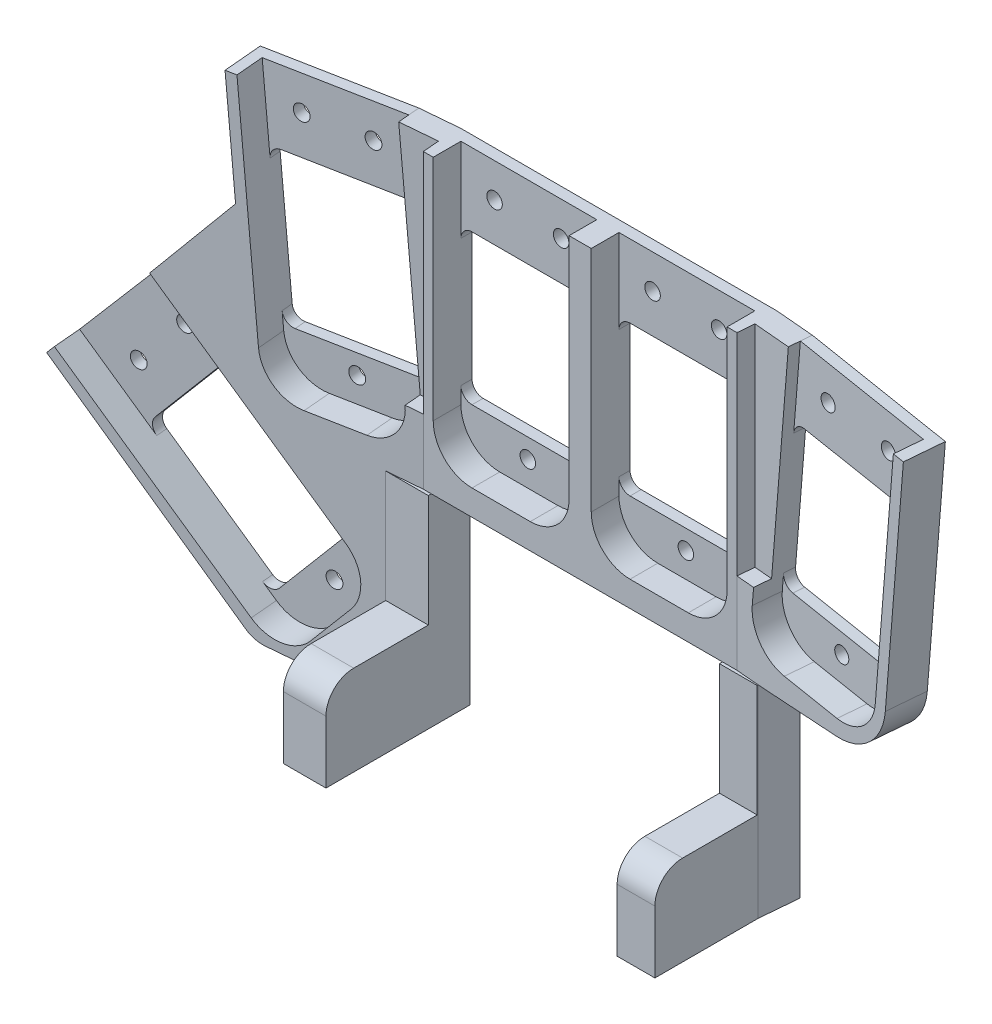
from build123d import *

# Parameters (mm, degrees)
EXTRUDE_3_DEPTH           = 2
EXTRUDE_4_DEPTH           = 5
SKETCH_5_R                = 1.4
CUT_EXTRUDE_1_DEPTH       = 5
EXTRUDE_5_DEPTH           = 52.129230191
SKETCH_8_R                = 1.4
CUT_EXTRUDE_2_DEPTH       = 54
EXTRUDE_6_DEPTH           = 5
EXTRUDE_7_DEPTH           = 52.129230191
EXTRUDE_8_DEPTH           = 5
SKETCH_12_R               = 1.4
CUT_EXTRUDE_3_DEPTH       = 5
EXTRUDE_9_DEPTH           = 48
SKETCH_16_W               = 1.992389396
SKETCH_16_H               = 100.129230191
EXTRUDE_10_DEPTH          = 31
EXTRUDE_12_DEPTH          = 5
SKETCH_20_R               = 1.4
CUT_EXTRUDE_4_DEPTH       = 5
SKETCH_22_R               = 1.4
CUT_EXTRUDE_5_DEPTH       = 126.647084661
CUT_EXTRUDE_6_DEPTH       = 126.647084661
CUT_EXTRUDE_7_DEPTH       = 126.549675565
SKETCH_25_W               = 6.808711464
SKETCH_25_H               = 36.46101183
SKETCH_25_W_2             = 7.679638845
EXTRUDE_14_DEPTH          = 19
CUT_EXTRUDE_8_DEPTH       = 123.081566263
CUT_EXTRUDE_8_DEPTH_BACK  = 123.081566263
SKETCH_26_W               = 24.786483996
SKETCH_26_H               = 10.930361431
SKETCH_26_W_2             = 52.20763572
SKETCH_26_W_3             = 6.238333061
CUT_EXTRUDE_9_DEPTH       = 116.857490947
CUT_EXTRUDE_10_DEPTH      = 118.224183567
CUT_EXTRUDE_11_DEPTH      = 118.323637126
CUT_EXTRUDE_11_DEPTH_BACK = 118.323637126
CUT_EXTRUDE_13_DEPTH      = 118.224183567
CUT_EXTRUDE_13_DEPTH_BACK = 118.224183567
CUT_EXTRUDE_15_DEPTH      = 3
CUT_EXTRUDE_16_DEPTH      = 3
SKETCH_35_W               = 52.511649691
SKETCH_35_H               = 36.46101183
CUT_EXTRUDE_18_DEPTH      = 11
SKETCH_36_R               = 1.4
CUT_EXTRUDE_19_DEPTH      = 5
FILLET_1_R                = 10
SKETCH_37_W               = 18.454216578
SKETCH_37_H               = 20.228048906
CUT_EXTRUDE_20_DEPTH      = 67
FILLET_2_R                = 5


with BuildPart() as part:
    # Sketch 1 → Extrude 3 (new body)
    with BuildSketch(Plane.XY):
        with BuildLine():
            ThreePointArc((-6.317132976, 11.564038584), (-6.902919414, 12.978252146), (-8.317132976, 13.564038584))
            Line((-8.317132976, 13.564038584), (-28.817132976, 13.564038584))
            ThreePointArc((-28.817132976, 13.564038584), (-30.231346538, 12.978252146), (-30.817132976, 11.564038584))
            Line((-30.817132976, 11.564038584), (-30.817132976, 26.719925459))
            Line((-30.817132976, 26.719925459), (-6.317132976, 26.719925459))
            Line((-6.317132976, 26.719925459), (-6.317132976, 11.564038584))
        make_face()
        with BuildLine():
            ThreePointArc((22.182867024, 11.564038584), (21.597080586, 12.978252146), (20.182867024, 13.564038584))
            Line((20.182867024, 13.564038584), (-0.317132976, 13.564038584))
            ThreePointArc((-0.317132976, 13.564038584), (-1.731346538, 12.978252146), (-2.317132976, 11.564038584))
            Line((-2.317132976, 11.564038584), (-2.317132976, 26.719925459))
            Line((-2.317132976, 26.719925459), (22.182867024, 26.719925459))
            Line((22.182867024, 26.719925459), (22.182867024, 11.564038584))
        make_face()
        with BuildLine():
            Line((-2.317132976, -11.435961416), (-2.317132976, -14.435961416))
            ThreePointArc((-2.317132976, -14.435961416), (-0.266880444, -19.385708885), (4.682867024, -21.435961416))
            Line((4.682867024, -21.435961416), (15.182867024, -21.435961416))
            ThreePointArc((15.182867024, -21.435961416), (20.132614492, -19.385708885), (22.182867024, -14.435961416))
            Line((22.182867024, -14.435961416), (22.182867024, -11.435961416))
            ThreePointArc((22.182867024, -11.435961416), (21.597080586, -12.850174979), (20.182867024, -13.435961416))
            Line((20.182867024, -13.435961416), (-0.317132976, -13.435961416))
            ThreePointArc((-0.317132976, -13.435961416), (-1.731346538, -12.850174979), (-2.317132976, -11.435961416))
        make_face()
        with BuildLine():
            Line((-30.817132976, -11.435961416), (-30.817132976, -14.435961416))
            ThreePointArc((-30.817132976, -14.435961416), (-28.766880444, -19.385708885), (-23.817132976, -21.435961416))
            Line((-23.817132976, -21.435961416), (-13.317132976, -21.435961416))
            ThreePointArc((-13.317132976, -21.435961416), (-8.367385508, -19.385708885), (-6.317132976, -14.435961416))
            Line((-6.317132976, -14.435961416), (-6.317132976, -11.435961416))
            ThreePointArc((-6.317132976, -11.435961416), (-6.902919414, -12.850174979), (-8.317132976, -13.435961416))
            Line((-8.317132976, -13.435961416), (-28.817132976, -13.435961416))
            ThreePointArc((-28.817132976, -13.435961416), (-30.231346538, -12.850174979), (-30.817132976, -11.435961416))
        make_face()
        with BuildLine():
            ThreePointArc((-2.317132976, -14.435961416), (-0.266880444, -19.385708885), (4.682867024, -21.435961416))
            Line((4.682867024, -21.435961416), (15.182867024, -21.435961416))
            ThreePointArc((15.182867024, -21.435961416), (20.132614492, -19.385708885), (22.182867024, -14.435961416))
            Line((22.182867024, -14.435961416), (22.182867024, -11.435961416))
            Line((22.182867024, -11.435961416), (22.182867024, 11.564038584))
            Line((22.182867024, 11.564038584), (22.182867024, 26.719925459))
            Line((22.182867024, 26.719925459), (24.182867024, 26.719925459))
            Line((24.182867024, 26.719925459), (24.182867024, -25.409304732))
            Line((24.182867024, -25.409304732), (-32.817132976, -25.409304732))
            Line((-32.817132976, -25.409304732), (-32.817132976, 26.719925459))
            Line((-32.817132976, 26.719925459), (-30.817132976, 26.719925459))
            Line((-30.817132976, 26.719925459), (-30.817132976, 11.564038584))
            Line((-30.817132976, 11.564038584), (-30.817132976, -11.435961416))
            Line((-30.817132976, -11.435961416), (-30.817132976, -14.435961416))
            ThreePointArc((-30.817132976, -14.435961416), (-28.766880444, -19.385708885), (-23.817132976, -21.435961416))
            Line((-23.817132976, -21.435961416), (-13.317132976, -21.435961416))
            ThreePointArc((-13.317132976, -21.435961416), (-8.367385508, -19.385708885), (-6.317132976, -14.435961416))
            Line((-6.317132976, -14.435961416), (-6.317132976, -11.435961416))
            Line((-6.317132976, -11.435961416), (-6.317132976, 11.564038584))
            Line((-6.317132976, 11.564038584), (-6.317132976, 26.719925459))
            Line((-6.317132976, 26.719925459), (-2.317132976, 26.719925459))
            Line((-2.317132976, 26.719925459), (-2.317132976, 11.564038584))
            Line((-2.317132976, 11.564038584), (-2.317132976, -11.435961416))
            Line((-2.317132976, -11.435961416), (-2.317132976, -14.435961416))
        make_face()
    extrude(amount=EXTRUDE_3_DEPTH)

    # Sketch 4 → Extrude 4 (add)
    with BuildSketch(Plane.XY.offset(2)):
        with BuildLine():
            Line((4.682867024, -21.435961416), (15.182867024, -21.435961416))
            ThreePointArc((15.182867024, -21.435961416), (20.132614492, -19.385708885), (22.182867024, -14.435961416))
            Line((22.182867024, -14.435961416), (22.182867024, -11.435961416))
            Line((22.182867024, -11.435961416), (22.182867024, 11.564038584))
            Line((22.182867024, 11.564038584), (22.182867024, 26.719925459))
            Line((22.182867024, 26.719925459), (24.182867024, 26.719925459))
            Line((24.182867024, 26.719925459), (24.182867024, -25.409304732))
            Line((24.182867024, -25.409304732), (-32.817132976, -25.409304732))
            Line((-32.817132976, -25.409304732), (-32.817132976, 26.719925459))
            Line((-32.817132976, 26.719925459), (-30.817132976, 26.719925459))
            Line((-30.817132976, 26.719925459), (-30.817132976, 11.564038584))
            Line((-30.817132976, 11.564038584), (-30.817132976, -11.435961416))
            Line((-30.817132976, -11.435961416), (-30.817132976, -14.435961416))
            ThreePointArc((-30.817132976, -14.435961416), (-28.766880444, -19.385708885), (-23.817132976, -21.435961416))
            Line((-23.817132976, -21.435961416), (-13.317132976, -21.435961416))
            ThreePointArc((-13.317132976, -21.435961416), (-8.367385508, -19.385708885), (-6.317132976, -14.435961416))
            Line((-6.317132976, -14.435961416), (-6.317132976, -11.435961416))
            Line((-6.317132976, -11.435961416), (-6.317132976, 11.564038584))
            Line((-6.317132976, 11.564038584), (-6.317132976, 26.719925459))
            Line((-6.317132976, 26.719925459), (-2.317132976, 26.719925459))
            Line((-2.317132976, 26.719925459), (-2.317132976, 11.564038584))
            Line((-2.317132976, 11.564038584), (-2.317132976, -11.435961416))
            Line((-2.317132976, -11.435961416), (-2.317132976, -14.435961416))
            ThreePointArc((-2.317132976, -14.435961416), (-0.266880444, -19.385708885), (4.682867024, -21.435961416))
        make_face()
    extrude(amount=EXTRUDE_4_DEPTH)

    # Sketch 5 → Cut-Extrude 1 (cut)
    with BuildSketch(Plane.XY.offset(2)):
        with Locations((9.746956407, -16.935961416)):
            Circle(SKETCH_5_R)
        with Locations((-18.753043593, -16.935961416)):
            Circle(SKETCH_5_R)
        with Locations((-24.753043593, 20.564038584)):
            Circle(SKETCH_5_R)
        with Locations((-12.753043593, 20.564038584)):
            Circle(SKETCH_5_R)
        with Locations((3.746956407, 20.564038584)):
            Circle(SKETCH_5_R)
        with Locations((15.746956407, 20.564038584)):
            Circle(SKETCH_5_R)
    extrude(amount=-CUT_EXTRUDE_1_DEPTH, mode=Mode.SUBTRACT)

    # Sketch 7 → Extrude 5 (add)
    with BuildSketch(Plane(origin=(0, 26.719925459, 0), x_dir=(1, 0, 0), z_dir=(0, 1, 0))):
        Polygon((-32.817132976, 0), (-70.226687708, -3.272911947), (-70.05303953, -5.2577197), (-32.817132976, -2), align=None)
    extrude(amount=-EXTRUDE_5_DEPTH)

    # Sketch 8 → Cut-Extrude 2 (cut)
    with BuildSketch(Plane(origin=(-0.075634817, 0, -0.864509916), x_dir=(0.9961946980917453, 0, -0.08715574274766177), z_dir=(0.08715574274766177, 0, 0.9961946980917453))):
        with Locations((-57.531809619, 18.980668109)):
            Circle(SKETCH_8_R)
        with Locations((-45.577473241, 20.026537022)):
            Circle(SKETCH_8_R)
        with Locations((-48.286301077, -17.853698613)):
            Circle(SKETCH_8_R)
        with BuildLine():
            Line((-38.381651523, 11.621711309), (-36.377069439, -11.290766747))
            ThreePointArc((-36.377069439, -11.290766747), (-36.837369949, -12.750653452), (-38.19514735, -13.457467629))
            Line((-38.19514735, -13.457467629), (-58.617138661, -15.244160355))
            ThreePointArc((-58.617138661, -15.244160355), (-60.077025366, -14.783859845), (-60.783839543, -13.426082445))
            Line((-60.783839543, -13.426082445), (-62.788421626, 9.486395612))
            ThreePointArc((-62.788421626, 9.486395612), (-62.328121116, 10.946282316), (-60.970343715, 11.653096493))
            Line((-60.970343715, 11.653096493), (-40.548352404, 13.43978922))
            ThreePointArc((-40.548352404, 13.43978922), (-39.088465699, 12.97948871), (-38.381651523, 11.621711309))
        make_face()
    extrude(amount=-CUT_EXTRUDE_2_DEPTH, mode=Mode.SUBTRACT)

    # Sketch 9 → Extrude 6 (add)
    with BuildSketch(Plane(origin=(-0.075634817, 0, -0.864509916), x_dir=(0.9961946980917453, 0, -0.08715574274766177), z_dir=(0.08715574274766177, 0, 0.9961946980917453))):
        with BuildLine():
            Line((-39.7025741, 26.719925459), (-38.381651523, 11.621711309))
            Line((-38.381651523, 11.621711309), (-36.377069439, -11.290766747))
            Line((-36.377069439, -11.290766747), (-36.115602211, -14.279350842))
            ThreePointArc((-36.115602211, -14.279350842), (-37.726653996, -19.388954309), (-42.478874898, -21.862803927))
            Line((-42.478874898, -21.862803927), (-52.938919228, -22.777939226))
            ThreePointArc((-52.938919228, -22.777939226), (-58.048522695, -21.166887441), (-60.522372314, -16.414666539))
            Line((-60.522372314, -16.414666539), (-60.783839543, -13.426082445))
            Line((-60.783839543, -13.426082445), (-62.788421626, 9.486395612))
            Line((-62.788421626, 9.486395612), (-64.29616012, 26.719925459))
            Line((-64.29616012, 26.719925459), (-66.29616012, 26.719925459))
            Line((-66.29616012, 26.719925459), (-61.73544344, -25.409304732))
            Line((-61.73544344, -25.409304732), (-32.866565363, -25.409304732))
            Line((-32.866565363, -25.409304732), (-32.866565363, 26.719925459))
            Line((-32.866565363, 26.719925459), (-39.7025741, 26.719925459))
        make_face()
    extrude(amount=EXTRUDE_6_DEPTH)

    # Sketch 10 → Extrude 7 (add)
    with BuildSketch(Plane(origin=(0, 26.719925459, 0), x_dir=(1, 0, 0), z_dir=(0, 1, 0))):
        Polygon((24.182867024, 0), (76.130717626, -4.544848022), (76.172198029, -6.548477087), (24.182867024, -2), align=None)
    extrude(amount=-EXTRUDE_7_DEPTH)

    # Sketch 11 → Extrude 8 (add)
    with BuildSketch(Plane(origin=(0.010047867, 0, -0.114847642), x_dir=(0.9961946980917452, 0, 0.08715574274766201), z_dir=(-0.08715574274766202, 0, 0.9961946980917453))):
        with BuildLine():
            Line((27.775659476, -11.290766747), (29.780241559, 11.621711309))
            Line((29.780241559, 11.621711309), (31.101164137, 26.719925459))
            Line((31.101164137, 26.719925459), (24.265155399, 26.719925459))
            Line((24.265155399, 26.719925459), (24.265155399, -25.409304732))
            Line((24.265155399, -25.409304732), (53.134033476, -25.409304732))
            Line((53.134033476, -25.409304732), (57.694750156, 26.719925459))
            Line((57.694750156, 26.719925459), (55.694750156, 26.719925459))
            Line((55.694750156, 26.719925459), (54.187011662, 9.486395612))
            Line((54.187011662, 9.486395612), (52.182429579, -13.426082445))
            Line((52.182429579, -13.426082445), (51.920962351, -16.414666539))
            ThreePointArc((51.920962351, -16.414666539), (49.447112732, -21.166887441), (44.337509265, -22.777939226))
            Line((44.337509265, -22.777939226), (33.877464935, -21.862803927))
            ThreePointArc((33.877464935, -21.862803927), (29.125244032, -19.388954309), (27.514192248, -14.279350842))
            Line((27.514192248, -14.279350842), (27.775659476, -11.290766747))
        make_face()
    extrude(amount=EXTRUDE_8_DEPTH)

    # Sketch 12 → Cut-Extrude 3 (cut)
    with BuildSketch(Plane(origin=(0.010047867, 0, -0.114847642), x_dir=(0.9961946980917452, 0, 0.08715574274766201), z_dir=(-0.08715574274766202, 0, 0.9961946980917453))):
        with Locations((36.605656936, 20.058943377)):
            Circle(SKETCH_12_R)
        with Locations((48.559993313, 19.013074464)):
            Circle(SKETCH_12_R)
        with Locations((39.314484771, -17.821292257)):
            Circle(SKETCH_12_R)
        with BuildLine():
            Line((50.015728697, -15.244160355), (29.593737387, -13.457467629))
            ThreePointArc((29.593737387, -13.457467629), (28.235959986, -12.750653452), (27.775659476, -11.290766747))
            Line((27.775659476, -11.290766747), (29.780241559, 11.621711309))
            ThreePointArc((29.780241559, 11.621711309), (30.487055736, 12.97948871), (31.946942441, 13.43978922))
            Line((31.946942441, 13.43978922), (52.368933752, 11.653096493))
            ThreePointArc((52.368933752, 11.653096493), (53.726711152, 10.946282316), (54.187011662, 9.486395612))
            Line((54.187011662, 9.486395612), (52.182429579, -13.426082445))
            ThreePointArc((52.182429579, -13.426082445), (51.475615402, -14.783859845), (50.015728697, -15.244160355))
        make_face()
    extrude(amount=-CUT_EXTRUDE_3_DEPTH, mode=Mode.SUBTRACT)

    # Sketch 14 → Extrude 9 (add)
    with BuildSketch(Plane.XZ.offset(25.409304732)):
        Polygon((52.50611159, 9.497062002), (23.964562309, 7), (-32.598828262, 7), (-61.140377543, 9.497062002), (-61.576156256, 4.516088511), (-70.05303953, 5.2577197), (-70.226687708, 3.272911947), (-32.817132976, 0), (24.182867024, 0), (76.130717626, 4.544848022), (76.172198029, 6.548477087), (52.941890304, 4.516088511), align=None)
    extrude(amount=EXTRUDE_9_DEPTH)

    # Sketch 16 → Extrude 10 (add)
    with BuildSketch(Plane(origin=(-69.977404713, 0, 6.122229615), x_dir=(0.0871557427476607, 0, 0.9961946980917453), z_dir=(-0.9961946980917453, 0, 0.0871557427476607))):
        with Locations((-1.864006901, -23.344689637)):
            Rectangle(SKETCH_16_W, SKETCH_16_H)
    extrude(amount=EXTRUDE_10_DEPTH)

    # Sketch 19 → Extrude 12 (add)
    with BuildSketch(Plane(origin=(-0.075634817, 0, -0.864509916), x_dir=(0.9961946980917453, 0, -0.08715574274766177), z_dir=(0.08715574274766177, 0, 0.9961946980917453))):
        Polygon((-66.29616012, 26.719925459), (-101.244707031, 26.719925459), (-101.244707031, -73.409304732), (-61.73544344, -73.409304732), (-61.73544344, -25.409304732), align=None)
    extrude(amount=EXTRUDE_12_DEPTH)

    # Sketch 20 → Cut-Extrude 4 (cut)
    # profile 1 of 6: a face of its own
    with BuildSketch(Plane(origin=(0.360143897, 0, 4.116463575), x_dir=(0.9961946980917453, 0, -0.08715574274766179), z_dir=(0.08715574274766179, 0, 0.9961946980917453))):
        with BuildLine():
            Line((-65.907799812, -23.656490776), (-48.28877762, -38.440605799))
            ThreePointArc((-48.28877762, -38.440605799), (-47.581963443, -39.7983832), (-48.042263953, -41.258269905))
            Line((-48.042263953, -41.258269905), (-61.219409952, -56.962180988))
            ThreePointArc((-61.219409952, -56.962180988), (-62.577187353, -57.668995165), (-64.037074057, -57.208694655))
            Line((-64.037074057, -57.208694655), (-81.656096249, -42.424579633))
            ThreePointArc((-81.656096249, -42.424579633), (-82.362910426, -41.066802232), (-81.902609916, -39.606915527))
            Line((-81.902609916, -39.606915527), (-68.725463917, -23.903004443))
            ThreePointArc((-68.725463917, -23.903004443), (-67.367686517, -23.196190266), (-65.907799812, -23.656490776))
        make_face()
    # profile 2 of 6: a face of its own
    with BuildSketch(Plane(origin=(0.360143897, 0, 4.116463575), x_dir=(0.9961946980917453, 0, -0.08715574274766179), z_dir=(0.08715574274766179, 0, 0.9961946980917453))):
        with BuildLine():
            ThreePointArc((-65.907799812, -23.656490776), (-67.367686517, -23.196190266), (-68.725463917, -23.903004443))
            Line((-68.725463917, -23.903004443), (-81.902609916, -39.606915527))
            ThreePointArc((-81.902609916, -39.606915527), (-82.362910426, -41.066802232), (-81.656096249, -42.424579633))
            Line((-81.656096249, -42.424579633), (-94.497779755, -31.649127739))
            Line((-94.497779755, -31.649127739), (-78.647244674, -12.966827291))
            Line((-78.647244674, -12.966827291), (-65.907799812, -23.656490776))
        make_face()
        with Locations((-84.652574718, -31.994129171)):
            Circle(SKETCH_20_R, mode=Mode.SUBTRACT)
        with Locations((-76.939123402, -22.801595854)):
            Circle(SKETCH_20_R, mode=Mode.SUBTRACT)
    # profile 3 of 6: a face of its own
    with BuildSketch(Plane(origin=(0.360143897, 0, 4.116463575), x_dir=(0.9961946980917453, 0, -0.08715574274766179), z_dir=(0.08715574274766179, 0, 0.9961946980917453))):
        with Locations((-84.652574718, -31.994129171)):
            Circle(SKETCH_20_R)
    # profile 4 of 6: a face of its own
    with BuildSketch(Plane(origin=(0.360143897, 0, 4.116463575), x_dir=(0.9961946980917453, 0, -0.08715574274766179), z_dir=(0.08715574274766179, 0, 0.9961946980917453))):
        with Locations((-76.939123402, -22.801595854)):
            Circle(SKETCH_20_R)
    # profile 5 of 6: a face of its own
    with BuildSketch(Plane(origin=(0.360143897, 0, 4.116463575), x_dir=(0.9961946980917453, 0, -0.08715574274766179), z_dir=(0.08715574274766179, 0, 0.9961946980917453))):
        with BuildLine():
            Line((-64.037074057, -57.208694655), (-61.738940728, -59.137057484))
            ThreePointArc((-61.738940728, -59.137057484), (-56.629337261, -60.748109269), (-51.877116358, -58.27425965))
            Line((-51.877116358, -58.27425965), (-45.127846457, -50.230792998))
            ThreePointArc((-45.127846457, -50.230792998), (-43.516794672, -45.121189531), (-45.990644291, -40.368968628))
            Line((-45.990644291, -40.368968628), (-48.28877762, -38.440605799))
            ThreePointArc((-48.28877762, -38.440605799), (-47.581963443, -39.7983832), (-48.042263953, -41.258269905))
            Line((-48.042263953, -41.258269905), (-61.219409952, -56.962180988))
            ThreePointArc((-61.219409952, -56.962180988), (-62.577187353, -57.668995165), (-64.037074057, -57.208694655))
        make_face()
        with Locations((-52.069182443, -51.502397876)):
            Circle(SKETCH_20_R, mode=Mode.SUBTRACT)
    # profile 6 of 6: a face of its own
    with BuildSketch(Plane(origin=(0.360143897, 0, 4.116463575), x_dir=(0.9961946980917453, 0, -0.08715574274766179), z_dir=(0.08715574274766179, 0, 0.9961946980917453))):
        with Locations((-52.069182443, -51.502397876)):
            Circle(SKETCH_20_R)
    extrude(amount=-CUT_EXTRUDE_4_DEPTH, mode=Mode.SUBTRACT)

    # Sketch 22 → Cut-Extrude 5 (cut, through all)
    with BuildSketch(Plane(origin=(-0.075634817, 0, -0.864509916), x_dir=(0.9961946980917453, 0, -0.08715574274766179), z_dir=(0.08715574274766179, 0, 0.9961946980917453))):
        with Locations((-76.939123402, -22.801595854)):
            Circle(SKETCH_22_R)
        with Locations((-84.652574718, -31.994129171)):
            Circle(SKETCH_22_R)
        with Locations((-52.069182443, -51.502397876)):
            Circle(SKETCH_22_R)
    extrude(amount=-CUT_EXTRUDE_5_DEPTH, mode=Mode.SUBTRACT)

    # Sketch 23 → Cut-Extrude 6 (cut, through all)
    with BuildSketch(Plane(origin=(-0.075634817, 0, -0.864509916), x_dir=(0.9961946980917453, 0, -0.08715574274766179), z_dir=(0.08715574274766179, 0, 0.9961946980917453))):
        with BuildLine():
            Line((-48.042263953, -41.258269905), (-61.219409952, -56.962180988))
            ThreePointArc((-61.219409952, -56.962180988), (-62.577187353, -57.668995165), (-64.037074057, -57.208694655))
            Line((-64.037074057, -57.208694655), (-81.656096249, -42.424579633))
            ThreePointArc((-81.656096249, -42.424579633), (-82.362910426, -41.066802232), (-81.902609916, -39.606915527))
            Line((-81.902609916, -39.606915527), (-68.725463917, -23.903004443))
            ThreePointArc((-68.725463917, -23.903004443), (-67.367686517, -23.196190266), (-65.907799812, -23.656490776))
            Line((-65.907799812, -23.656490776), (-48.28877762, -38.440605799))
            ThreePointArc((-48.28877762, -38.440605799), (-47.581963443, -39.7983832), (-48.042263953, -41.258269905))
        make_face()
    extrude(amount=-CUT_EXTRUDE_6_DEPTH, mode=Mode.SUBTRACT)

    # Sketch 24 → Cut-Extrude 7 (cut, through all)
    with BuildSketch(Plane(origin=(0.360143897, 0, 4.116463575), x_dir=(0.9961946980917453, 0, -0.08715574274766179), z_dir=(0.08715574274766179, 0, 0.9961946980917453))):
        Polygon((-78.647244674, -12.966827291), (-94.497779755, -31.649127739), (-95.791681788, -33.174190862), (-48.368394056, -73.409304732), (-101.244707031, -73.409304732), (-101.244707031, 26.719925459), (-66.29616012, 26.719925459), (-64.33890811, 4.348432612), align=None)
    extrude(amount=-CUT_EXTRUDE_7_DEPTH, mode=Mode.SUBTRACT)

    # Sketch 25 → Extrude 14 (add)
    with BuildSketch(Plane.XY.offset(7)):
        with Locations((24.758482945, -44.248437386)):
            Rectangle(SKETCH_25_W, SKETCH_25_H)
        with Locations((-34.997341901, -44.248437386)):
            Rectangle(SKETCH_25_W_2, SKETCH_25_H)
    extrude(amount=EXTRUDE_14_DEPTH)

    # Sketch 26 → Cut-Extrude 8 (cut, two sides: drawn at the far end of the back side and taken through both)
    with BuildSketch(Plane.XY.offset(7).offset(-CUT_EXTRUDE_8_DEPTH_BACK)):
        with Locations((-51.230403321, -67.944124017)):
            Rectangle(SKETCH_26_W, SKETCH_26_H)
        Polygon((-31.157522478, -62.478943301), (-32.598828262, -62.478943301), (-32.598828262, -73.409304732), (23.964562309, -73.409304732), (23.964562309, -62.478943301), (21.354127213, -62.478943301), align=None)
        with Locations((50.068380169, -67.944124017)):
            Rectangle(SKETCH_26_W_2, SKETCH_26_H)
        with Locations((-35.717994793, -67.944124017)):
            Rectangle(SKETCH_26_W_3, SKETCH_26_H)
    extrude(amount=CUT_EXTRUDE_8_DEPTH + CUT_EXTRUDE_8_DEPTH_BACK, mode=Mode.SUBTRACT)

    # Sketch 27 → Cut-Extrude 9 (cut, through all)
    with BuildSketch(Plane(origin=(-0.425730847, 0, 4.866125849), x_dir=(0.9961946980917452, 0, 0.08715574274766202), z_dir=(-0.08715574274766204, 0, 0.9961946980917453))):
        Polygon((53.134033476, -25.409304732), (28.697773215, -26.017931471), (28.697773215, -62.478943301), (53.134033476, -62.478943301), align=None)
    extrude(amount=-CUT_EXTRUDE_9_DEPTH, mode=Mode.SUBTRACT)

    # Sketch 28 → Cut-Extrude 10 (cut, through all)
    with BuildSketch(Plane(origin=(0.010047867, 0, -0.114847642), x_dir=(0.9961946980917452, 0, 0.08715574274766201), z_dir=(-0.08715574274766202, 0, 0.9961946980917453))):
        Polygon((76.453077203, -62.478943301), (76.453077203, 26.719925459), (57.694750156, 26.719925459), (53.134033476, -25.409304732), (53.134033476, -62.478943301), align=None)
    extrude(amount=-CUT_EXTRUDE_10_DEPTH, mode=Mode.SUBTRACT)

    # Sketch 29 → Cut-Extrude 11 (cut, two sides: drawn at the far end of the back side and taken through both)
    with BuildSketch(Plane(origin=(-0.075634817, 0, -0.864509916), x_dir=(0.9961946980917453, 0, -0.08715574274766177), z_dir=(0.08715574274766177, 0, 0.9961946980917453)).offset(-CUT_EXTRUDE_11_DEPTH_BACK)):
        Polygon((-39.7025741, 26.719925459), (-66.094151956, 24.410961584), (-66.29616012, 26.719925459), align=None)
    extrude(amount=CUT_EXTRUDE_11_DEPTH + CUT_EXTRUDE_11_DEPTH_BACK, mode=Mode.SUBTRACT)

    # Sketch 31 → Cut-Extrude 13 (cut, two sides: drawn at the far end of the back side and taken through both)
    with BuildSketch(Plane(origin=(0.010047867, 0, -0.114847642), x_dir=(0.9961946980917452, 0, 0.08715574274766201), z_dir=(-0.08715574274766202, 0, 0.9961946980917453)).offset(-CUT_EXTRUDE_13_DEPTH_BACK)):
        Polygon((31.101164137, 26.719925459), (57.492741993, 24.410961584), (57.694750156, 26.719925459), align=None)
    extrude(amount=CUT_EXTRUDE_13_DEPTH + CUT_EXTRUDE_13_DEPTH_BACK, mode=Mode.SUBTRACT)

    # Sketch 33 → Cut-Extrude 15 (cut)
    with BuildSketch(Plane(origin=(0.360143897, 0, 4.116463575), x_dir=(0.9961946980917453, 0, -0.08715574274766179), z_dir=(0.08715574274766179, 0, 0.9961946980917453))):
        Polygon((-39.7025741, 26.719925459), (-33.084870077, 26.719925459), (-33.084870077, -14.279350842), (-36.115602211, -14.279350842), align=None)
    extrude(amount=-CUT_EXTRUDE_15_DEPTH, mode=Mode.SUBTRACT)

    # Sketch 34 → Cut-Extrude 16 (cut)
    with BuildSketch(Plane(origin=(-0.425730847, 0, 4.866125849), x_dir=(0.9961946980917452, 0, 0.08715574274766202), z_dir=(-0.08715574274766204, 0, 0.9961946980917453))):
        Polygon((31.101164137, 26.719925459), (27.775659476, -11.290766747), (24.483460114, -11.290766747), (24.483460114, 26.719925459), align=None)
    extrude(amount=-CUT_EXTRUDE_16_DEPTH, mode=Mode.SUBTRACT)

    # Sketch 35 → Cut-Extrude 18 (cut)
    with BuildSketch(Plane.XY.offset(7)):
        with Locations((-4.901697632, -44.248437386)):
            Rectangle(SKETCH_35_W, SKETCH_35_H)
    extrude(amount=-CUT_EXTRUDE_18_DEPTH, mode=Mode.SUBTRACT)

    # Sketch 36 → Cut-Extrude 19 (cut)
    with BuildSketch(Plane.XZ.offset(62.478943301)):
        with Locations(Location((25.048382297, 3, 0), (0, 0, 270))):
            Circle(SKETCH_36_R)
        with Locations(Location((25.048382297, 21, 0), (0, 0, 270))):
            Circle(SKETCH_36_R)
        with Locations(Location((-35.951617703, 3, 0), (0, 0, 270))):
            Circle(SKETCH_36_R)
        with Locations(Location((-35.951617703, 21, 0), (0, 0, 270))):
            Circle(SKETCH_36_R)
    extrude(amount=-CUT_EXTRUDE_19_DEPTH, mode=Mode.SUBTRACT)

    # Fillet 1
    fillet_1_edges = [part.edges().sort_by_distance(p)[0] for p in [
        (52.810825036, -25.409304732, 6.01417138),
    ]]
    fillet(fillet_1_edges, radius=FILLET_1_R)

    # Sketch 37 → Cut-Extrude 20 (cut)
    with BuildSketch(Plane.ZY.offset(38.837161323)):
        with Locations((16.772891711, -36.131955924)):
            Rectangle(SKETCH_37_W, SKETCH_37_H)
    extrude(amount=-CUT_EXTRUDE_20_DEPTH, mode=Mode.SUBTRACT)

    # Fillet 2
    fillet_2_edges = [part.edges().sort_by_distance(p)[0] for p in [
        (-60.963000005, -62.478943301, 5.971993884),
        (-34.997341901, -46.245980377, 26),
        (24.758482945, -46.245980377, 26),
    ]]
    fillet(fillet_2_edges, radius=FILLET_2_R)


solid = part.part
